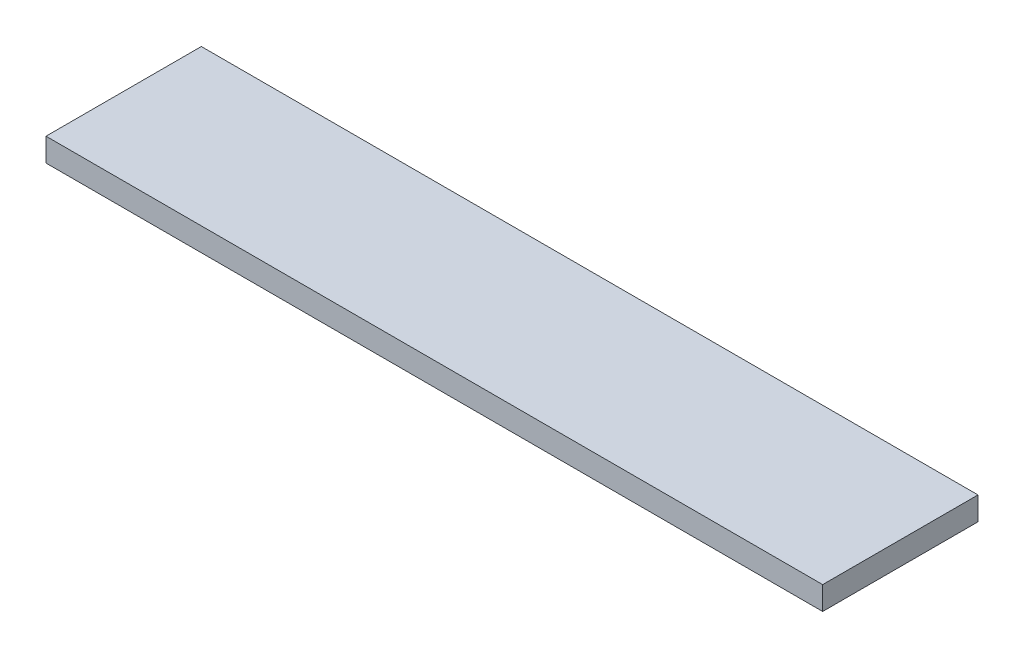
ISO-10303-21;
HEADER;
FILE_DESCRIPTION(('STEP AP214'),'2;1');
FILE_NAME('part.step','',(''),(''),'','','');
FILE_SCHEMA(('AUTOMOTIVE_DESIGN { 1 0 10303 214 1 1 1 1 }'));
ENDSEC;
DATA;
#1=APPLICATION_CONTEXT('core data for automotive mechanical design processes');
#2=APPLICATION_PROTOCOL_DEFINITION('international standard','automotive_design',2000,#1);
#3=PRODUCT_CONTEXT('',#1,'mechanical');
#4=PRODUCT('Part','Part','',(#3));
#5=PRODUCT_RELATED_PRODUCT_CATEGORY('part','',(#4));
#6=PRODUCT_DEFINITION_FORMATION('','',#4);
#7=PRODUCT_DEFINITION_CONTEXT('part definition',#1,'design');
#8=PRODUCT_DEFINITION('design','',#6,#7);
#9=PRODUCT_DEFINITION_SHAPE('','',#8);
#10=(LENGTH_UNIT() NAMED_UNIT(*) SI_UNIT(.MILLI.,.METRE.));
#11=(NAMED_UNIT(*) PLANE_ANGLE_UNIT() SI_UNIT($,.RADIAN.));
#12=(NAMED_UNIT(*) SI_UNIT($,.STERADIAN.) SOLID_ANGLE_UNIT());
#13=UNCERTAINTY_MEASURE_WITH_UNIT(LENGTH_MEASURE(1.E-05),#10,'distance_accuracy_value','');
#14=(GEOMETRIC_REPRESENTATION_CONTEXT(3) GLOBAL_UNCERTAINTY_ASSIGNED_CONTEXT((#13)) GLOBAL_UNIT_ASSIGNED_CONTEXT((#10,
#11,#12)) REPRESENTATION_CONTEXT('',''));
#15=CARTESIAN_POINT('',(0.,0.,0.));
#16=DIRECTION('',(0.,0.,1.));
#17=DIRECTION('',(1.,0.,0.));
#18=AXIS2_PLACEMENT_3D('',#15,#16,#17);
#19=CARTESIAN_POINT('',(1000.,15.,100.));
#20=DIRECTION('',(-1.,0.,0.));
#21=DIRECTION('',(0.,0.,1.));
#22=AXIS2_PLACEMENT_3D('',#19,#20,#21);
#23=PLANE('',#22);
#24=DIRECTION('',(0.,1.,0.));
#25=VECTOR('',#24,1.);
#26=CARTESIAN_POINT('',(1000.,15.,-100.));
#27=LINE('',#26,#25);
#28=CARTESIAN_POINT('',(1000.,-15.,-100.));
#29=VERTEX_POINT('',#28);
#30=CARTESIAN_POINT('',(1000.,15.,-100.));
#31=VERTEX_POINT('',#30);
#32=EDGE_CURVE('E98',#29,#31,#27,.T.);
#33=ORIENTED_EDGE('',*,*,#32,.T.);
#34=DIRECTION('',(0.,0.,-1.));
#35=VECTOR('',#34,1.);
#36=CARTESIAN_POINT('',(1000.,15.,100.));
#37=LINE('',#36,#35);
#38=CARTESIAN_POINT('',(1000.,15.,100.));
#39=VERTEX_POINT('',#38);
#40=EDGE_CURVE('E11',#39,#31,#37,.T.);
#41=ORIENTED_EDGE('',*,*,#40,.F.);
#42=DIRECTION('',(0.,1.,0.));
#43=VECTOR('',#42,1.);
#44=CARTESIAN_POINT('',(1000.,15.,100.));
#45=LINE('',#44,#43);
#46=CARTESIAN_POINT('',(1000.,-15.,100.));
#47=VERTEX_POINT('',#46);
#48=EDGE_CURVE('E86',#47,#39,#45,.T.);
#49=ORIENTED_EDGE('',*,*,#48,.F.);
#50=DIRECTION('',(0.,0.,-1.));
#51=VECTOR('',#50,1.);
#52=CARTESIAN_POINT('',(1000.,-15.,100.));
#53=LINE('',#52,#51);
#54=EDGE_CURVE('E94',#47,#29,#53,.T.);
#55=ORIENTED_EDGE('',*,*,#54,.T.);
#56=EDGE_LOOP('',(#33,#41,#49,#55));
#57=FACE_BOUND('',#56,.T.);
#58=ADVANCED_FACE('F35',(#57),#23,.F.);
#59=CARTESIAN_POINT('',(0.,15.,100.));
#60=DIRECTION('',(0.,-1.,0.));
#61=DIRECTION('',(0.,0.,-1.));
#62=AXIS2_PLACEMENT_3D('',#59,#60,#61);
#63=PLANE('',#62);
#64=DIRECTION('',(-1.,0.,0.));
#65=VECTOR('',#64,1.);
#66=CARTESIAN_POINT('',(0.,15.,-100.));
#67=LINE('',#66,#65);
#68=CARTESIAN_POINT('',(0.,15.,-100.));
#69=VERTEX_POINT('',#68);
#70=EDGE_CURVE('E90',#31,#69,#67,.T.);
#71=ORIENTED_EDGE('',*,*,#70,.T.);
#72=DIRECTION('',(0.,0.,-1.));
#73=VECTOR('',#72,1.);
#74=CARTESIAN_POINT('',(0.,15.,100.));
#75=LINE('',#74,#73);
#76=CARTESIAN_POINT('',(0.,15.,100.));
#77=VERTEX_POINT('',#76);
#78=EDGE_CURVE('E43',#77,#69,#75,.T.);
#79=ORIENTED_EDGE('',*,*,#78,.F.);
#80=DIRECTION('',(-1.,0.,0.));
#81=VECTOR('',#80,1.);
#82=CARTESIAN_POINT('',(0.,15.,100.));
#83=LINE('',#82,#81);
#84=EDGE_CURVE('E81',#39,#77,#83,.T.);
#85=ORIENTED_EDGE('',*,*,#84,.F.);
#86=ORIENTED_EDGE('',*,*,#40,.T.);
#87=EDGE_LOOP('',(#71,#79,#85,#86));
#88=FACE_BOUND('',#87,.T.);
#89=ADVANCED_FACE('F89',(#88),#63,.F.);
#90=CARTESIAN_POINT('',(0.,15.,100.));
#91=DIRECTION('',(1.,0.,0.));
#92=DIRECTION('',(0.,0.,-1.));
#93=AXIS2_PLACEMENT_3D('',#90,#91,#92);
#94=PLANE('',#93);
#95=DIRECTION('',(0.,-1.,0.));
#96=VECTOR('',#95,1.);
#97=CARTESIAN_POINT('',(0.,15.,-100.));
#98=LINE('',#97,#96);
#99=CARTESIAN_POINT('',(0.,-15.,-100.));
#100=VERTEX_POINT('',#99);
#101=EDGE_CURVE('E68',#69,#100,#98,.T.);
#102=ORIENTED_EDGE('',*,*,#101,.T.);
#103=DIRECTION('',(0.,0.,-1.));
#104=VECTOR('',#103,1.);
#105=CARTESIAN_POINT('',(0.,-15.,100.));
#106=LINE('',#105,#104);
#107=CARTESIAN_POINT('',(0.,-15.,100.));
#108=VERTEX_POINT('',#107);
#109=EDGE_CURVE('E91',#108,#100,#106,.T.);
#110=ORIENTED_EDGE('',*,*,#109,.F.);
#111=DIRECTION('',(0.,-1.,0.));
#112=VECTOR('',#111,1.);
#113=CARTESIAN_POINT('',(0.,15.,100.));
#114=LINE('',#113,#112);
#115=EDGE_CURVE('E84',#77,#108,#114,.T.);
#116=ORIENTED_EDGE('',*,*,#115,.F.);
#117=ORIENTED_EDGE('',*,*,#78,.T.);
#118=EDGE_LOOP('',(#102,#110,#116,#117));
#119=FACE_BOUND('',#118,.T.);
#120=ADVANCED_FACE('F92',(#119),#94,.F.);
#121=CARTESIAN_POINT('',(0.,-15.,100.));
#122=DIRECTION('',(0.,1.,0.));
#123=DIRECTION('',(0.,0.,1.));
#124=AXIS2_PLACEMENT_3D('',#121,#122,#123);
#125=PLANE('',#124);
#126=DIRECTION('',(1.,0.,0.));
#127=VECTOR('',#126,1.);
#128=CARTESIAN_POINT('',(0.,-15.,-100.));
#129=LINE('',#128,#127);
#130=EDGE_CURVE('E74',#100,#29,#129,.T.);
#131=ORIENTED_EDGE('',*,*,#130,.T.);
#132=ORIENTED_EDGE('',*,*,#54,.F.);
#133=DIRECTION('',(1.,0.,0.));
#134=VECTOR('',#133,1.);
#135=CARTESIAN_POINT('',(0.,-15.,100.));
#136=LINE('',#135,#134);
#137=EDGE_CURVE('E51',#108,#47,#136,.T.);
#138=ORIENTED_EDGE('',*,*,#137,.F.);
#139=ORIENTED_EDGE('',*,*,#109,.T.);
#140=EDGE_LOOP('',(#131,#132,#138,#139));
#141=FACE_BOUND('',#140,.T.);
#142=ADVANCED_FACE('F105',(#141),#125,.F.);
#143=CARTESIAN_POINT('',(0.,0.,100.));
#144=DIRECTION('',(0.,0.,1.));
#145=DIRECTION('',(1.,0.,0.));
#146=AXIS2_PLACEMENT_3D('',#143,#144,#145);
#147=PLANE('',#146);
#148=ORIENTED_EDGE('',*,*,#48,.T.);
#149=ORIENTED_EDGE('',*,*,#84,.T.);
#150=ORIENTED_EDGE('',*,*,#115,.T.);
#151=ORIENTED_EDGE('',*,*,#137,.T.);
#152=EDGE_LOOP('',(#148,#149,#150,#151));
#153=FACE_BOUND('',#152,.T.);
#154=ADVANCED_FACE('F82',(#153),#147,.T.);
#155=CARTESIAN_POINT('',(0.,0.,-100.));
#156=DIRECTION('',(0.,0.,1.));
#157=DIRECTION('',(1.,0.,0.));
#158=AXIS2_PLACEMENT_3D('',#155,#156,#157);
#159=PLANE('',#158);
#160=ORIENTED_EDGE('',*,*,#32,.F.);
#161=ORIENTED_EDGE('',*,*,#130,.F.);
#162=ORIENTED_EDGE('',*,*,#101,.F.);
#163=ORIENTED_EDGE('',*,*,#70,.F.);
#164=EDGE_LOOP('',(#160,#161,#162,#163));
#165=FACE_BOUND('',#164,.T.);
#166=ADVANCED_FACE('F108',(#165),#159,.F.);
#167=CLOSED_SHELL('',(#58,#89,#120,#142,#154,#166));
#168=MANIFOLD_SOLID_BREP('B2',#167);
#169=ADVANCED_BREP_SHAPE_REPRESENTATION('',(#18,#168),#14);
#170=SHAPE_DEFINITION_REPRESENTATION(#9,#169);
ENDSEC;
END-ISO-10303-21;
